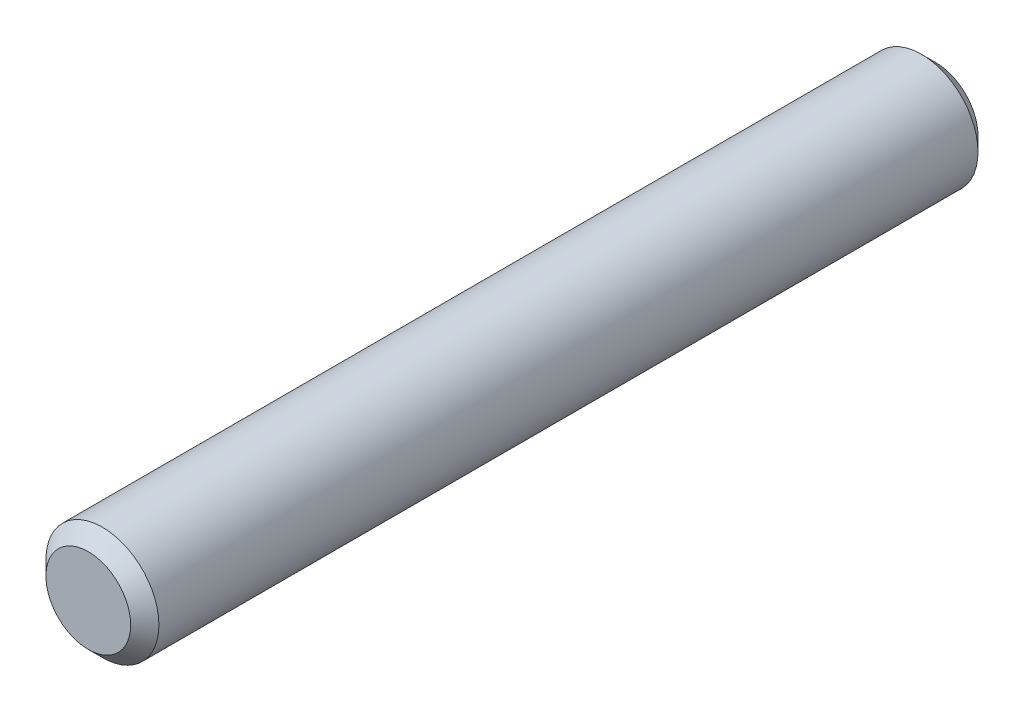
from build123d import *

# Parameters (mm, degrees)
SKETCH_1_R      = 2
EXTRUDE_1_DEPTH = 30
CHAMFER_1_SIZE  = 0.5


with BuildPart() as part:
    # Sketch 1 → Extrude 1 (new body)
    with BuildSketch(Plane.XY):
        Circle(SKETCH_1_R)
    extrude(amount=-EXTRUDE_1_DEPTH)

    # Chamfer 1
    chamfer_1_edges = [part.edges().sort_by_distance(p)[0] for p in [
        (-2, 0, 0),
        (-2, 0, -30),
    ]]
    chamfer(chamfer_1_edges, length=CHAMFER_1_SIZE)


solid = part.part
